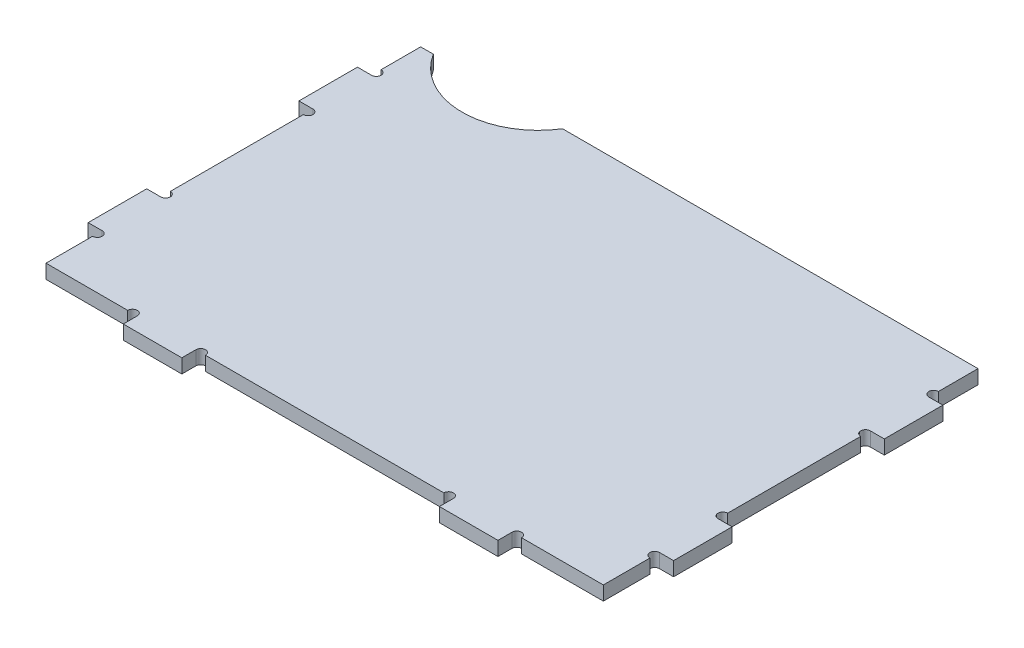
ISO-10303-21;
HEADER;
FILE_DESCRIPTION(('STEP AP214'),'2;1');
FILE_NAME('part.step','',(''),(''),'','','');
FILE_SCHEMA(('AUTOMOTIVE_DESIGN { 1 0 10303 214 1 1 1 1 }'));
ENDSEC;
DATA;
#1=APPLICATION_CONTEXT('core data for automotive mechanical design processes');
#2=APPLICATION_PROTOCOL_DEFINITION('international standard','automotive_design',2000,#1);
#3=PRODUCT_CONTEXT('',#1,'mechanical');
#4=PRODUCT('Part','Part','',(#3));
#5=PRODUCT_RELATED_PRODUCT_CATEGORY('part','',(#4));
#6=PRODUCT_DEFINITION_FORMATION('','',#4);
#7=PRODUCT_DEFINITION_CONTEXT('part definition',#1,'design');
#8=PRODUCT_DEFINITION('design','',#6,#7);
#9=PRODUCT_DEFINITION_SHAPE('','',#8);
#10=(LENGTH_UNIT() NAMED_UNIT(*) SI_UNIT(.MILLI.,.METRE.));
#11=(NAMED_UNIT(*) PLANE_ANGLE_UNIT() SI_UNIT($,.RADIAN.));
#12=(NAMED_UNIT(*) SI_UNIT($,.STERADIAN.) SOLID_ANGLE_UNIT());
#13=UNCERTAINTY_MEASURE_WITH_UNIT(LENGTH_MEASURE(1.E-05),#10,'distance_accuracy_value','');
#14=(GEOMETRIC_REPRESENTATION_CONTEXT(3) GLOBAL_UNCERTAINTY_ASSIGNED_CONTEXT((#13)) GLOBAL_UNIT_ASSIGNED_CONTEXT((#10,
#11,#12)) REPRESENTATION_CONTEXT('',''));
#15=CARTESIAN_POINT('',(0.,0.,0.));
#16=DIRECTION('',(0.,0.,1.));
#17=DIRECTION('',(1.,0.,0.));
#18=AXIS2_PLACEMENT_3D('',#15,#16,#17);
#19=CARTESIAN_POINT('',(105.9,12.,0.));
#20=DIRECTION('',(0.,-1.,0.));
#21=DIRECTION('',(0.,0.,-1.));
#22=AXIS2_PLACEMENT_3D('',#19,#20,#21);
#23=CYLINDRICAL_SURFACE('',#22,4.1);
#24=CARTESIAN_POINT('',(105.9,0.,0.));
#25=DIRECTION('',(0.,-1.,0.));
#26=DIRECTION('',(0.,0.,1.));
#27=AXIS2_PLACEMENT_3D('',#24,#25,#26);
#28=CIRCLE('',#27,4.1);
#29=CARTESIAN_POINT('',(101.8,0.,0.));
#30=VERTEX_POINT('',#29);
#31=CARTESIAN_POINT('',(110.,0.,0.));
#32=VERTEX_POINT('',#31);
#33=EDGE_CURVE('E335',#30,#32,#28,.T.);
#34=ORIENTED_EDGE('',*,*,#33,.T.);
#35=DIRECTION('',(0.,-1.,0.));
#36=VECTOR('',#35,1.);
#37=CARTESIAN_POINT('',(110.,12.,0.));
#38=LINE('',#37,#36);
#39=CARTESIAN_POINT('',(110.,12.,0.));
#40=VERTEX_POINT('',#39);
#41=EDGE_CURVE('E11',#40,#32,#38,.T.);
#42=ORIENTED_EDGE('',*,*,#41,.F.);
#43=CARTESIAN_POINT('',(105.9,12.,0.));
#44=DIRECTION('',(0.,-1.,0.));
#45=DIRECTION('',(0.,0.,1.));
#46=AXIS2_PLACEMENT_3D('',#43,#44,#45);
#47=CIRCLE('',#46,4.1);
#48=CARTESIAN_POINT('',(101.8,12.,0.));
#49=VERTEX_POINT('',#48);
#50=EDGE_CURVE('E417',#49,#40,#47,.T.);
#51=ORIENTED_EDGE('',*,*,#50,.F.);
#52=DIRECTION('',(0.,-1.,0.));
#53=VECTOR('',#52,1.);
#54=CARTESIAN_POINT('',(101.8,12.,0.));
#55=LINE('',#54,#53);
#56=EDGE_CURVE('E331',#49,#30,#55,.T.);
#57=ORIENTED_EDGE('',*,*,#56,.T.);
#58=EDGE_LOOP('',(#34,#42,#51,#57));
#59=FACE_BOUND('',#58,.T.);
#60=ADVANCED_FACE('F35',(#59),#23,.F.);
#61=CARTESIAN_POINT('',(110.,12.,0.));
#62=DIRECTION('',(1.,0.,0.));
#63=DIRECTION('',(0.,0.,-1.));
#64=AXIS2_PLACEMENT_3D('',#61,#62,#63);
#65=PLANE('',#64);
#66=DIRECTION('',(0.,0.,1.));
#67=VECTOR('',#66,1.);
#68=CARTESIAN_POINT('',(110.,0.,0.));
#69=LINE('',#68,#67);
#70=CARTESIAN_POINT('',(110.,0.,12.));
#71=VERTEX_POINT('',#70);
#72=EDGE_CURVE('E338',#32,#71,#69,.T.);
#73=ORIENTED_EDGE('',*,*,#72,.T.);
#74=DIRECTION('',(0.,-1.,0.));
#75=VECTOR('',#74,1.);
#76=CARTESIAN_POINT('',(110.,12.,12.));
#77=LINE('',#76,#75);
#78=CARTESIAN_POINT('',(110.,12.,12.));
#79=VERTEX_POINT('',#78);
#80=EDGE_CURVE('E43',#79,#71,#77,.T.);
#81=ORIENTED_EDGE('',*,*,#80,.F.);
#82=DIRECTION('',(0.,0.,1.));
#83=VECTOR('',#82,1.);
#84=CARTESIAN_POINT('',(110.,12.,0.));
#85=LINE('',#84,#83);
#86=EDGE_CURVE('E196',#40,#79,#85,.T.);
#87=ORIENTED_EDGE('',*,*,#86,.F.);
#88=ORIENTED_EDGE('',*,*,#41,.T.);
#89=EDGE_LOOP('',(#73,#81,#87,#88));
#90=FACE_BOUND('',#89,.T.);
#91=ADVANCED_FACE('F645',(#90),#65,.F.);
#92=CARTESIAN_POINT('',(110.,12.,12.));
#93=DIRECTION('',(0.,0.,-1.));
#94=DIRECTION('',(-1.,0.,0.));
#95=AXIS2_PLACEMENT_3D('',#92,#93,#94);
#96=PLANE('',#95);
#97=DIRECTION('',(1.,0.,0.));
#98=VECTOR('',#97,1.);
#99=CARTESIAN_POINT('',(110.,0.,12.));
#100=LINE('',#99,#98);
#101=CARTESIAN_POINT('',(160.,0.,12.));
#102=VERTEX_POINT('',#101);
#103=EDGE_CURVE('E340',#71,#102,#100,.T.);
#104=ORIENTED_EDGE('',*,*,#103,.T.);
#105=DIRECTION('',(0.,-1.,0.));
#106=VECTOR('',#105,1.);
#107=CARTESIAN_POINT('',(160.,12.,12.));
#108=LINE('',#107,#106);
#109=CARTESIAN_POINT('',(160.,12.,12.));
#110=VERTEX_POINT('',#109);
#111=EDGE_CURVE('E526',#110,#102,#108,.T.);
#112=ORIENTED_EDGE('',*,*,#111,.F.);
#113=DIRECTION('',(1.,0.,0.));
#114=VECTOR('',#113,1.);
#115=CARTESIAN_POINT('',(110.,12.,12.));
#116=LINE('',#115,#114);
#117=EDGE_CURVE('E534',#79,#110,#116,.T.);
#118=ORIENTED_EDGE('',*,*,#117,.F.);
#119=ORIENTED_EDGE('',*,*,#80,.T.);
#120=EDGE_LOOP('',(#104,#112,#118,#119));
#121=FACE_BOUND('',#120,.T.);
#122=ADVANCED_FACE('F532',(#121),#96,.F.);
#123=CARTESIAN_POINT('',(160.,12.,12.));
#124=DIRECTION('',(-1.,0.,0.));
#125=DIRECTION('',(0.,0.,1.));
#126=AXIS2_PLACEMENT_3D('',#123,#124,#125);
#127=PLANE('',#126);
#128=DIRECTION('',(0.,0.,-1.));
#129=VECTOR('',#128,1.);
#130=CARTESIAN_POINT('',(160.,0.,12.));
#131=LINE('',#130,#129);
#132=CARTESIAN_POINT('',(160.,0.,0.));
#133=VERTEX_POINT('',#132);
#134=EDGE_CURVE('E342',#102,#133,#131,.T.);
#135=ORIENTED_EDGE('',*,*,#134,.T.);
#136=DIRECTION('',(0.,-1.,0.));
#137=VECTOR('',#136,1.);
#138=CARTESIAN_POINT('',(160.,12.,0.));
#139=LINE('',#138,#137);
#140=CARTESIAN_POINT('',(160.,12.,0.));
#141=VERTEX_POINT('',#140);
#142=EDGE_CURVE('E523',#141,#133,#139,.T.);
#143=ORIENTED_EDGE('',*,*,#142,.F.);
#144=DIRECTION('',(0.,0.,-1.));
#145=VECTOR('',#144,1.);
#146=CARTESIAN_POINT('',(160.,12.,12.));
#147=LINE('',#146,#145);
#148=EDGE_CURVE('E552',#110,#141,#147,.T.);
#149=ORIENTED_EDGE('',*,*,#148,.F.);
#150=ORIENTED_EDGE('',*,*,#111,.T.);
#151=EDGE_LOOP('',(#135,#143,#149,#150));
#152=FACE_BOUND('',#151,.T.);
#153=ADVANCED_FACE('F543',(#152),#127,.F.);
#154=CARTESIAN_POINT('',(164.1,12.,0.));
#155=DIRECTION('',(0.,-1.,0.));
#156=DIRECTION('',(0.,0.,-1.));
#157=AXIS2_PLACEMENT_3D('',#154,#155,#156);
#158=CYLINDRICAL_SURFACE('',#157,4.09999999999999);
#159=CARTESIAN_POINT('',(164.1,0.,0.));
#160=DIRECTION('',(0.,-1.,0.));
#161=DIRECTION('',(0.,0.,-1.));
#162=AXIS2_PLACEMENT_3D('',#159,#160,#161);
#163=CIRCLE('',#162,4.09999999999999);
#164=CARTESIAN_POINT('',(168.2,0.,0.));
#165=VERTEX_POINT('',#164);
#166=EDGE_CURVE('E344',#133,#165,#163,.T.);
#167=ORIENTED_EDGE('',*,*,#166,.T.);
#168=DIRECTION('',(0.,-1.,0.));
#169=VECTOR('',#168,1.);
#170=CARTESIAN_POINT('',(168.2,12.,0.));
#171=LINE('',#170,#169);
#172=CARTESIAN_POINT('',(168.2,12.,0.));
#173=VERTEX_POINT('',#172);
#174=EDGE_CURVE('E520',#173,#165,#171,.T.);
#175=ORIENTED_EDGE('',*,*,#174,.F.);
#176=CARTESIAN_POINT('',(164.1,12.,0.));
#177=DIRECTION('',(0.,-1.,0.));
#178=DIRECTION('',(0.,0.,-1.));
#179=AXIS2_PLACEMENT_3D('',#176,#177,#178);
#180=CIRCLE('',#179,4.09999999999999);
#181=EDGE_CURVE('E549',#141,#173,#180,.T.);
#182=ORIENTED_EDGE('',*,*,#181,.F.);
#183=ORIENTED_EDGE('',*,*,#142,.T.);
#184=EDGE_LOOP('',(#167,#175,#182,#183));
#185=FACE_BOUND('',#184,.T.);
#186=ADVANCED_FACE('F547',(#185),#158,.F.);
#187=CARTESIAN_POINT('',(168.2,12.,0.));
#188=DIRECTION('',(0.,0.,-1.));
#189=DIRECTION('',(-1.,0.,0.));
#190=AXIS2_PLACEMENT_3D('',#187,#188,#189);
#191=PLANE('',#190);
#192=DIRECTION('',(1.,0.,0.));
#193=VECTOR('',#192,1.);
#194=CARTESIAN_POINT('',(168.2,0.,0.));
#195=LINE('',#194,#193);
#196=CARTESIAN_POINT('',(238.,0.,0.));
#197=VERTEX_POINT('',#196);
#198=EDGE_CURVE('E346',#165,#197,#195,.T.);
#199=ORIENTED_EDGE('',*,*,#198,.T.);
#200=DIRECTION('',(0.,-1.,0.));
#201=VECTOR('',#200,1.);
#202=CARTESIAN_POINT('',(238.,12.,0.));
#203=LINE('',#202,#201);
#204=CARTESIAN_POINT('',(238.,12.,0.));
#205=VERTEX_POINT('',#204);
#206=EDGE_CURVE('E517',#205,#197,#203,.T.);
#207=ORIENTED_EDGE('',*,*,#206,.F.);
#208=DIRECTION('',(1.,0.,0.));
#209=VECTOR('',#208,1.);
#210=CARTESIAN_POINT('',(168.2,12.,0.));
#211=LINE('',#210,#209);
#212=EDGE_CURVE('E551',#173,#205,#211,.T.);
#213=ORIENTED_EDGE('',*,*,#212,.F.);
#214=ORIENTED_EDGE('',*,*,#174,.T.);
#215=EDGE_LOOP('',(#199,#207,#213,#214));
#216=FACE_BOUND('',#215,.T.);
#217=ADVANCED_FACE('F658',(#216),#191,.F.);
#218=CARTESIAN_POINT('',(238.,12.,0.));
#219=DIRECTION('',(-1.,0.,0.));
#220=DIRECTION('',(0.,0.,1.));
#221=AXIS2_PLACEMENT_3D('',#218,#219,#220);
#222=PLANE('',#221);
#223=DIRECTION('',(0.,0.,-1.));
#224=VECTOR('',#223,1.);
#225=CARTESIAN_POINT('',(238.,0.,0.));
#226=LINE('',#225,#224);
#227=CARTESIAN_POINT('',(238.,0.,-39.8));
#228=VERTEX_POINT('',#227);
#229=EDGE_CURVE('E348',#197,#228,#226,.T.);
#230=ORIENTED_EDGE('',*,*,#229,.T.);
#231=DIRECTION('',(0.,-1.,0.));
#232=VECTOR('',#231,1.);
#233=CARTESIAN_POINT('',(238.,12.,-39.8));
#234=LINE('',#233,#232);
#235=CARTESIAN_POINT('',(238.,12.,-39.8));
#236=VERTEX_POINT('',#235);
#237=EDGE_CURVE('E514',#236,#228,#234,.T.);
#238=ORIENTED_EDGE('',*,*,#237,.F.);
#239=DIRECTION('',(0.,0.,-1.));
#240=VECTOR('',#239,1.);
#241=CARTESIAN_POINT('',(238.,12.,0.));
#242=LINE('',#241,#240);
#243=EDGE_CURVE('E554',#205,#236,#242,.T.);
#244=ORIENTED_EDGE('',*,*,#243,.F.);
#245=ORIENTED_EDGE('',*,*,#206,.T.);
#246=EDGE_LOOP('',(#230,#238,#244,#245));
#247=FACE_BOUND('',#246,.T.);
#248=ADVANCED_FACE('F661',(#247),#222,.F.);
#249=CARTESIAN_POINT('',(238.,12.,-43.9));
#250=DIRECTION('',(0.,-1.,0.));
#251=DIRECTION('',(0.,0.,-1.));
#252=AXIS2_PLACEMENT_3D('',#249,#250,#251);
#253=CYLINDRICAL_SURFACE('',#252,4.1);
#254=CARTESIAN_POINT('',(238.,0.,-43.9));
#255=DIRECTION('',(0.,-1.,0.));
#256=DIRECTION('',(0.,0.,1.));
#257=AXIS2_PLACEMENT_3D('',#254,#255,#256);
#258=CIRCLE('',#257,4.1);
#259=CARTESIAN_POINT('',(238.,0.,-48.));
#260=VERTEX_POINT('',#259);
#261=EDGE_CURVE('E350',#228,#260,#258,.T.);
#262=ORIENTED_EDGE('',*,*,#261,.T.);
#263=DIRECTION('',(0.,-1.,0.));
#264=VECTOR('',#263,1.);
#265=CARTESIAN_POINT('',(238.,12.,-48.));
#266=LINE('',#265,#264);
#267=CARTESIAN_POINT('',(238.,12.,-48.));
#268=VERTEX_POINT('',#267);
#269=EDGE_CURVE('E511',#268,#260,#266,.T.);
#270=ORIENTED_EDGE('',*,*,#269,.F.);
#271=CARTESIAN_POINT('',(238.,12.,-43.9));
#272=DIRECTION('',(0.,-1.,0.));
#273=DIRECTION('',(0.,0.,1.));
#274=AXIS2_PLACEMENT_3D('',#271,#272,#273);
#275=CIRCLE('',#274,4.1);
#276=EDGE_CURVE('E560',#236,#268,#275,.T.);
#277=ORIENTED_EDGE('',*,*,#276,.F.);
#278=ORIENTED_EDGE('',*,*,#237,.T.);
#279=EDGE_LOOP('',(#262,#270,#277,#278));
#280=FACE_BOUND('',#279,.T.);
#281=ADVANCED_FACE('F665',(#280),#253,.F.);
#282=CARTESIAN_POINT('',(238.,12.,-48.));
#283=DIRECTION('',(0.,0.,-1.));
#284=DIRECTION('',(-1.,0.,0.));
#285=AXIS2_PLACEMENT_3D('',#282,#283,#284);
#286=PLANE('',#285);
#287=DIRECTION('',(1.,0.,0.));
#288=VECTOR('',#287,1.);
#289=CARTESIAN_POINT('',(238.,0.,-48.));
#290=LINE('',#289,#288);
#291=CARTESIAN_POINT('',(250.,0.,-48.));
#292=VERTEX_POINT('',#291);
#293=EDGE_CURVE('E352',#260,#292,#290,.T.);
#294=ORIENTED_EDGE('',*,*,#293,.T.);
#295=DIRECTION('',(0.,-1.,0.));
#296=VECTOR('',#295,1.);
#297=CARTESIAN_POINT('',(250.,12.,-48.));
#298=LINE('',#297,#296);
#299=CARTESIAN_POINT('',(250.,12.,-48.));
#300=VERTEX_POINT('',#299);
#301=EDGE_CURVE('E508',#300,#292,#298,.T.);
#302=ORIENTED_EDGE('',*,*,#301,.F.);
#303=DIRECTION('',(1.,0.,0.));
#304=VECTOR('',#303,1.);
#305=CARTESIAN_POINT('',(238.,12.,-48.));
#306=LINE('',#305,#304);
#307=EDGE_CURVE('E562',#268,#300,#306,.T.);
#308=ORIENTED_EDGE('',*,*,#307,.F.);
#309=ORIENTED_EDGE('',*,*,#269,.T.);
#310=EDGE_LOOP('',(#294,#302,#308,#309));
#311=FACE_BOUND('',#310,.T.);
#312=ADVANCED_FACE('F669',(#311),#286,.F.);
#313=CARTESIAN_POINT('',(250.,12.,-48.));
#314=DIRECTION('',(-1.,0.,0.));
#315=DIRECTION('',(0.,0.,1.));
#316=AXIS2_PLACEMENT_3D('',#313,#314,#315);
#317=PLANE('',#316);
#318=DIRECTION('',(0.,0.,-1.));
#319=VECTOR('',#318,1.);
#320=CARTESIAN_POINT('',(250.,0.,-48.));
#321=LINE('',#320,#319);
#322=CARTESIAN_POINT('',(250.,0.,-98.));
#323=VERTEX_POINT('',#322);
#324=EDGE_CURVE('E354',#292,#323,#321,.T.);
#325=ORIENTED_EDGE('',*,*,#324,.T.);
#326=DIRECTION('',(0.,-1.,0.));
#327=VECTOR('',#326,1.);
#328=CARTESIAN_POINT('',(250.,12.,-98.));
#329=LINE('',#328,#327);
#330=CARTESIAN_POINT('',(250.,12.,-98.));
#331=VERTEX_POINT('',#330);
#332=EDGE_CURVE('E505',#331,#323,#329,.T.);
#333=ORIENTED_EDGE('',*,*,#332,.F.);
#334=DIRECTION('',(0.,0.,-1.));
#335=VECTOR('',#334,1.);
#336=CARTESIAN_POINT('',(250.,12.,-48.));
#337=LINE('',#336,#335);
#338=EDGE_CURVE('E564',#300,#331,#337,.T.);
#339=ORIENTED_EDGE('',*,*,#338,.F.);
#340=ORIENTED_EDGE('',*,*,#301,.T.);
#341=EDGE_LOOP('',(#325,#333,#339,#340));
#342=FACE_BOUND('',#341,.T.);
#343=ADVANCED_FACE('F673',(#342),#317,.F.);
#344=CARTESIAN_POINT('',(250.,12.,-98.));
#345=DIRECTION('',(0.,0.,1.));
#346=DIRECTION('',(1.,0.,0.));
#347=AXIS2_PLACEMENT_3D('',#344,#345,#346);
#348=PLANE('',#347);
#349=DIRECTION('',(-1.,0.,0.));
#350=VECTOR('',#349,1.);
#351=CARTESIAN_POINT('',(250.,0.,-98.));
#352=LINE('',#351,#350);
#353=CARTESIAN_POINT('',(238.,0.,-98.));
#354=VERTEX_POINT('',#353);
#355=EDGE_CURVE('E356',#323,#354,#352,.T.);
#356=ORIENTED_EDGE('',*,*,#355,.T.);
#357=DIRECTION('',(0.,-1.,0.));
#358=VECTOR('',#357,1.);
#359=CARTESIAN_POINT('',(238.,12.,-98.));
#360=LINE('',#359,#358);
#361=CARTESIAN_POINT('',(238.,12.,-98.));
#362=VERTEX_POINT('',#361);
#363=EDGE_CURVE('E502',#362,#354,#360,.T.);
#364=ORIENTED_EDGE('',*,*,#363,.F.);
#365=DIRECTION('',(-1.,0.,0.));
#366=VECTOR('',#365,1.);
#367=CARTESIAN_POINT('',(250.,12.,-98.));
#368=LINE('',#367,#366);
#369=EDGE_CURVE('E566',#331,#362,#368,.T.);
#370=ORIENTED_EDGE('',*,*,#369,.F.);
#371=ORIENTED_EDGE('',*,*,#332,.T.);
#372=EDGE_LOOP('',(#356,#364,#370,#371));
#373=FACE_BOUND('',#372,.T.);
#374=ADVANCED_FACE('F677',(#373),#348,.F.);
#375=CARTESIAN_POINT('',(238.,12.,-102.1));
#376=DIRECTION('',(0.,-1.,0.));
#377=DIRECTION('',(0.,0.,-1.));
#378=AXIS2_PLACEMENT_3D('',#375,#376,#377);
#379=CYLINDRICAL_SURFACE('',#378,4.1);
#380=CARTESIAN_POINT('',(238.,0.,-102.1));
#381=DIRECTION('',(0.,-1.,0.));
#382=DIRECTION('',(0.,0.,-1.));
#383=AXIS2_PLACEMENT_3D('',#380,#381,#382);
#384=CIRCLE('',#383,4.1);
#385=CARTESIAN_POINT('',(238.,0.,-106.2));
#386=VERTEX_POINT('',#385);
#387=EDGE_CURVE('E358',#354,#386,#384,.T.);
#388=ORIENTED_EDGE('',*,*,#387,.T.);
#389=DIRECTION('',(0.,-1.,0.));
#390=VECTOR('',#389,1.);
#391=CARTESIAN_POINT('',(238.,12.,-106.2));
#392=LINE('',#391,#390);
#393=CARTESIAN_POINT('',(238.,12.,-106.2));
#394=VERTEX_POINT('',#393);
#395=EDGE_CURVE('E499',#394,#386,#392,.T.);
#396=ORIENTED_EDGE('',*,*,#395,.F.);
#397=CARTESIAN_POINT('',(238.,12.,-102.1));
#398=DIRECTION('',(0.,-1.,0.));
#399=DIRECTION('',(0.,0.,-1.));
#400=AXIS2_PLACEMENT_3D('',#397,#398,#399);
#401=CIRCLE('',#400,4.1);
#402=EDGE_CURVE('E568',#362,#394,#401,.T.);
#403=ORIENTED_EDGE('',*,*,#402,.F.);
#404=ORIENTED_EDGE('',*,*,#363,.T.);
#405=EDGE_LOOP('',(#388,#396,#403,#404));
#406=FACE_BOUND('',#405,.T.);
#407=ADVANCED_FACE('F681',(#406),#379,.F.);
#408=CARTESIAN_POINT('',(238.,12.,-106.2));
#409=DIRECTION('',(-1.,0.,0.));
#410=DIRECTION('',(0.,0.,1.));
#411=AXIS2_PLACEMENT_3D('',#408,#409,#410);
#412=PLANE('',#411);
#413=DIRECTION('',(0.,0.,-1.));
#414=VECTOR('',#413,1.);
#415=CARTESIAN_POINT('',(238.,0.,-106.2));
#416=LINE('',#415,#414);
#417=CARTESIAN_POINT('',(238.,0.,-219.8));
#418=VERTEX_POINT('',#417);
#419=EDGE_CURVE('E360',#386,#418,#416,.T.);
#420=ORIENTED_EDGE('',*,*,#419,.T.);
#421=DIRECTION('',(0.,-1.,0.));
#422=VECTOR('',#421,1.);
#423=CARTESIAN_POINT('',(238.,12.,-219.8));
#424=LINE('',#423,#422);
#425=CARTESIAN_POINT('',(238.,12.,-219.8));
#426=VERTEX_POINT('',#425);
#427=EDGE_CURVE('E496',#426,#418,#424,.T.);
#428=ORIENTED_EDGE('',*,*,#427,.F.);
#429=DIRECTION('',(0.,0.,-1.));
#430=VECTOR('',#429,1.);
#431=CARTESIAN_POINT('',(238.,12.,-106.2));
#432=LINE('',#431,#430);
#433=EDGE_CURVE('E570',#394,#426,#432,.T.);
#434=ORIENTED_EDGE('',*,*,#433,.F.);
#435=ORIENTED_EDGE('',*,*,#395,.T.);
#436=EDGE_LOOP('',(#420,#428,#434,#435));
#437=FACE_BOUND('',#436,.T.);
#438=ADVANCED_FACE('F685',(#437),#412,.F.);
#439=CARTESIAN_POINT('',(238.,12.,-223.9));
#440=DIRECTION('',(0.,-1.,0.));
#441=DIRECTION('',(0.,0.,-1.));
#442=AXIS2_PLACEMENT_3D('',#439,#440,#441);
#443=CYLINDRICAL_SURFACE('',#442,4.09999999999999);
#444=CARTESIAN_POINT('',(238.,0.,-223.9));
#445=DIRECTION('',(0.,-1.,0.));
#446=DIRECTION('',(0.,0.,1.));
#447=AXIS2_PLACEMENT_3D('',#444,#445,#446);
#448=CIRCLE('',#447,4.09999999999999);
#449=CARTESIAN_POINT('',(238.,0.,-228.));
#450=VERTEX_POINT('',#449);
#451=EDGE_CURVE('E362',#418,#450,#448,.T.);
#452=ORIENTED_EDGE('',*,*,#451,.T.);
#453=DIRECTION('',(0.,-1.,0.));
#454=VECTOR('',#453,1.);
#455=CARTESIAN_POINT('',(238.,12.,-228.));
#456=LINE('',#455,#454);
#457=CARTESIAN_POINT('',(238.,12.,-228.));
#458=VERTEX_POINT('',#457);
#459=EDGE_CURVE('E493',#458,#450,#456,.T.);
#460=ORIENTED_EDGE('',*,*,#459,.F.);
#461=CARTESIAN_POINT('',(238.,12.,-223.9));
#462=DIRECTION('',(0.,-1.,0.));
#463=DIRECTION('',(0.,0.,1.));
#464=AXIS2_PLACEMENT_3D('',#461,#462,#463);
#465=CIRCLE('',#464,4.09999999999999);
#466=EDGE_CURVE('E572',#426,#458,#465,.T.);
#467=ORIENTED_EDGE('',*,*,#466,.F.);
#468=ORIENTED_EDGE('',*,*,#427,.T.);
#469=EDGE_LOOP('',(#452,#460,#467,#468));
#470=FACE_BOUND('',#469,.T.);
#471=ADVANCED_FACE('F689',(#470),#443,.F.);
#472=CARTESIAN_POINT('',(238.,12.,-228.));
#473=DIRECTION('',(0.,0.,-1.));
#474=DIRECTION('',(-1.,0.,0.));
#475=AXIS2_PLACEMENT_3D('',#472,#473,#474);
#476=PLANE('',#475);
#477=DIRECTION('',(1.,0.,0.));
#478=VECTOR('',#477,1.);
#479=CARTESIAN_POINT('',(238.,0.,-228.));
#480=LINE('',#479,#478);
#481=CARTESIAN_POINT('',(250.,0.,-228.));
#482=VERTEX_POINT('',#481);
#483=EDGE_CURVE('E364',#450,#482,#480,.T.);
#484=ORIENTED_EDGE('',*,*,#483,.T.);
#485=DIRECTION('',(0.,-1.,0.));
#486=VECTOR('',#485,1.);
#487=CARTESIAN_POINT('',(250.,12.,-228.));
#488=LINE('',#487,#486);
#489=CARTESIAN_POINT('',(250.,12.,-228.));
#490=VERTEX_POINT('',#489);
#491=EDGE_CURVE('E490',#490,#482,#488,.T.);
#492=ORIENTED_EDGE('',*,*,#491,.F.);
#493=DIRECTION('',(1.,0.,0.));
#494=VECTOR('',#493,1.);
#495=CARTESIAN_POINT('',(238.,12.,-228.));
#496=LINE('',#495,#494);
#497=EDGE_CURVE('E574',#458,#490,#496,.T.);
#498=ORIENTED_EDGE('',*,*,#497,.F.);
#499=ORIENTED_EDGE('',*,*,#459,.T.);
#500=EDGE_LOOP('',(#484,#492,#498,#499));
#501=FACE_BOUND('',#500,.T.);
#502=ADVANCED_FACE('F693',(#501),#476,.F.);
#503=CARTESIAN_POINT('',(250.,12.,-228.));
#504=DIRECTION('',(-1.,0.,0.));
#505=DIRECTION('',(0.,0.,1.));
#506=AXIS2_PLACEMENT_3D('',#503,#504,#505);
#507=PLANE('',#506);
#508=DIRECTION('',(0.,0.,-1.));
#509=VECTOR('',#508,1.);
#510=CARTESIAN_POINT('',(250.,0.,-228.));
#511=LINE('',#510,#509);
#512=CARTESIAN_POINT('',(250.,0.,-278.));
#513=VERTEX_POINT('',#512);
#514=EDGE_CURVE('E366',#482,#513,#511,.T.);
#515=ORIENTED_EDGE('',*,*,#514,.T.);
#516=DIRECTION('',(0.,-1.,0.));
#517=VECTOR('',#516,1.);
#518=CARTESIAN_POINT('',(250.,12.,-278.));
#519=LINE('',#518,#517);
#520=CARTESIAN_POINT('',(250.,12.,-278.));
#521=VERTEX_POINT('',#520);
#522=EDGE_CURVE('E487',#521,#513,#519,.T.);
#523=ORIENTED_EDGE('',*,*,#522,.F.);
#524=DIRECTION('',(0.,0.,-1.));
#525=VECTOR('',#524,1.);
#526=CARTESIAN_POINT('',(250.,12.,-228.));
#527=LINE('',#526,#525);
#528=EDGE_CURVE('E576',#490,#521,#527,.T.);
#529=ORIENTED_EDGE('',*,*,#528,.F.);
#530=ORIENTED_EDGE('',*,*,#491,.T.);
#531=EDGE_LOOP('',(#515,#523,#529,#530));
#532=FACE_BOUND('',#531,.T.);
#533=ADVANCED_FACE('F697',(#532),#507,.F.);
#534=CARTESIAN_POINT('',(250.,12.,-278.));
#535=DIRECTION('',(0.,0.,1.));
#536=DIRECTION('',(1.,0.,0.));
#537=AXIS2_PLACEMENT_3D('',#534,#535,#536);
#538=PLANE('',#537);
#539=DIRECTION('',(-1.,0.,0.));
#540=VECTOR('',#539,1.);
#541=CARTESIAN_POINT('',(250.,0.,-278.));
#542=LINE('',#541,#540);
#543=CARTESIAN_POINT('',(238.,0.,-278.));
#544=VERTEX_POINT('',#543);
#545=EDGE_CURVE('E368',#513,#544,#542,.T.);
#546=ORIENTED_EDGE('',*,*,#545,.T.);
#547=DIRECTION('',(0.,-1.,0.));
#548=VECTOR('',#547,1.);
#549=CARTESIAN_POINT('',(238.,12.,-278.));
#550=LINE('',#549,#548);
#551=CARTESIAN_POINT('',(238.,12.,-278.));
#552=VERTEX_POINT('',#551);
#553=EDGE_CURVE('E484',#552,#544,#550,.T.);
#554=ORIENTED_EDGE('',*,*,#553,.F.);
#555=DIRECTION('',(-1.,0.,0.));
#556=VECTOR('',#555,1.);
#557=CARTESIAN_POINT('',(250.,12.,-278.));
#558=LINE('',#557,#556);
#559=EDGE_CURVE('E578',#521,#552,#558,.T.);
#560=ORIENTED_EDGE('',*,*,#559,.F.);
#561=ORIENTED_EDGE('',*,*,#522,.T.);
#562=EDGE_LOOP('',(#546,#554,#560,#561));
#563=FACE_BOUND('',#562,.T.);
#564=ADVANCED_FACE('F701',(#563),#538,.F.);
#565=CARTESIAN_POINT('',(238.,12.,-282.1));
#566=DIRECTION('',(0.,-1.,0.));
#567=DIRECTION('',(0.,0.,-1.));
#568=AXIS2_PLACEMENT_3D('',#565,#566,#567);
#569=CYLINDRICAL_SURFACE('',#568,4.09999999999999);
#570=CARTESIAN_POINT('',(238.,0.,-282.1));
#571=DIRECTION('',(0.,-1.,0.));
#572=DIRECTION('',(0.,0.,-1.));
#573=AXIS2_PLACEMENT_3D('',#570,#571,#572);
#574=CIRCLE('',#573,4.09999999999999);
#575=CARTESIAN_POINT('',(238.,0.,-286.2));
#576=VERTEX_POINT('',#575);
#577=EDGE_CURVE('E370',#544,#576,#574,.T.);
#578=ORIENTED_EDGE('',*,*,#577,.T.);
#579=DIRECTION('',(0.,-1.,0.));
#580=VECTOR('',#579,1.);
#581=CARTESIAN_POINT('',(238.,12.,-286.2));
#582=LINE('',#581,#580);
#583=CARTESIAN_POINT('',(238.,12.,-286.2));
#584=VERTEX_POINT('',#583);
#585=EDGE_CURVE('E481',#584,#576,#582,.T.);
#586=ORIENTED_EDGE('',*,*,#585,.F.);
#587=CARTESIAN_POINT('',(238.,12.,-282.1));
#588=DIRECTION('',(0.,-1.,0.));
#589=DIRECTION('',(0.,0.,-1.));
#590=AXIS2_PLACEMENT_3D('',#587,#588,#589);
#591=CIRCLE('',#590,4.09999999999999);
#592=EDGE_CURVE('E580',#552,#584,#591,.T.);
#593=ORIENTED_EDGE('',*,*,#592,.F.);
#594=ORIENTED_EDGE('',*,*,#553,.T.);
#595=EDGE_LOOP('',(#578,#586,#593,#594));
#596=FACE_BOUND('',#595,.T.);
#597=ADVANCED_FACE('F705',(#596),#569,.F.);
#598=CARTESIAN_POINT('',(238.,12.,-286.2));
#599=DIRECTION('',(-1.,0.,0.));
#600=DIRECTION('',(0.,0.,1.));
#601=AXIS2_PLACEMENT_3D('',#598,#599,#600);
#602=PLANE('',#601);
#603=DIRECTION('',(0.,0.,-1.));
#604=VECTOR('',#603,1.);
#605=CARTESIAN_POINT('',(238.,0.,-286.2));
#606=LINE('',#605,#604);
#607=CARTESIAN_POINT('',(238.,0.,-320.));
#608=VERTEX_POINT('',#607);
#609=EDGE_CURVE('E372',#576,#608,#606,.T.);
#610=ORIENTED_EDGE('',*,*,#609,.T.);
#611=DIRECTION('',(0.,-1.,0.));
#612=VECTOR('',#611,1.);
#613=CARTESIAN_POINT('',(238.,12.,-320.));
#614=LINE('',#613,#612);
#615=CARTESIAN_POINT('',(238.,12.,-320.));
#616=VERTEX_POINT('',#615);
#617=EDGE_CURVE('E478',#616,#608,#614,.T.);
#618=ORIENTED_EDGE('',*,*,#617,.F.);
#619=DIRECTION('',(0.,0.,-1.));
#620=VECTOR('',#619,1.);
#621=CARTESIAN_POINT('',(238.,12.,-286.2));
#622=LINE('',#621,#620);
#623=EDGE_CURVE('E582',#584,#616,#622,.T.);
#624=ORIENTED_EDGE('',*,*,#623,.F.);
#625=ORIENTED_EDGE('',*,*,#585,.T.);
#626=EDGE_LOOP('',(#610,#618,#624,#625));
#627=FACE_BOUND('',#626,.T.);
#628=ADVANCED_FACE('F709',(#627),#602,.F.);
#629=CARTESIAN_POINT('',(238.,12.,-320.));
#630=DIRECTION('',(0.,0.,1.));
#631=DIRECTION('',(1.,0.,0.));
#632=AXIS2_PLACEMENT_3D('',#629,#630,#631);
#633=PLANE('',#632);
#634=DIRECTION('',(-1.,0.,0.));
#635=VECTOR('',#634,1.);
#636=CARTESIAN_POINT('',(238.,0.,-320.));
#637=LINE('',#636,#635);
#638=CARTESIAN_POINT('',(-116.824005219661,0.,-320.));
#639=VERTEX_POINT('',#638);
#640=EDGE_CURVE('E374',#608,#639,#637,.T.);
#641=ORIENTED_EDGE('',*,*,#640,.T.);
#642=DIRECTION('',(0.,-1.,0.));
#643=VECTOR('',#642,1.);
#644=CARTESIAN_POINT('',(-116.824005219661,12.,-320.));
#645=LINE('',#644,#643);
#646=CARTESIAN_POINT('',(-116.824005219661,12.,-320.));
#647=VERTEX_POINT('',#646);
#648=EDGE_CURVE('E475',#647,#639,#645,.T.);
#649=ORIENTED_EDGE('',*,*,#648,.F.);
#650=DIRECTION('',(-1.,0.,0.));
#651=VECTOR('',#650,1.);
#652=CARTESIAN_POINT('',(238.,12.,-320.));
#653=LINE('',#652,#651);
#654=EDGE_CURVE('E584',#616,#647,#653,.T.);
#655=ORIENTED_EDGE('',*,*,#654,.F.);
#656=ORIENTED_EDGE('',*,*,#617,.T.);
#657=EDGE_LOOP('',(#641,#649,#655,#656));
#658=FACE_BOUND('',#657,.T.);
#659=ADVANCED_FACE('F713',(#658),#633,.F.);
#660=CARTESIAN_POINT('',(-172.,12.,-354.36));
#661=DIRECTION('',(0.,-1.,0.));
#662=DIRECTION('',(0.,0.,-1.));
#663=AXIS2_PLACEMENT_3D('',#660,#661,#662);
#664=CYLINDRICAL_SURFACE('',#663,65.);
#665=CARTESIAN_POINT('',(-172.,0.,-354.36));
#666=DIRECTION('',(0.,-1.,0.));
#667=DIRECTION('',(0.,0.,1.));
#668=AXIS2_PLACEMENT_3D('',#665,#666,#667);
#669=CIRCLE('',#668,65.);
#670=CARTESIAN_POINT('',(-227.175994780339,0.,-320.));
#671=VERTEX_POINT('',#670);
#672=EDGE_CURVE('E376',#639,#671,#669,.T.);
#673=ORIENTED_EDGE('',*,*,#672,.T.);
#674=DIRECTION('',(0.,-1.,0.));
#675=VECTOR('',#674,1.);
#676=CARTESIAN_POINT('',(-227.175994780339,12.,-320.));
#677=LINE('',#676,#675);
#678=CARTESIAN_POINT('',(-227.175994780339,12.,-320.));
#679=VERTEX_POINT('',#678);
#680=EDGE_CURVE('E472',#679,#671,#677,.T.);
#681=ORIENTED_EDGE('',*,*,#680,.F.);
#682=CARTESIAN_POINT('',(-172.,12.,-354.36));
#683=DIRECTION('',(0.,-1.,0.));
#684=DIRECTION('',(0.,0.,1.));
#685=AXIS2_PLACEMENT_3D('',#682,#683,#684);
#686=CIRCLE('',#685,65.);
#687=EDGE_CURVE('E586',#647,#679,#686,.T.);
#688=ORIENTED_EDGE('',*,*,#687,.F.);
#689=ORIENTED_EDGE('',*,*,#648,.T.);
#690=EDGE_LOOP('',(#673,#681,#688,#689));
#691=FACE_BOUND('',#690,.T.);
#692=ADVANCED_FACE('F717',(#691),#664,.F.);
#693=CARTESIAN_POINT('',(-238.,12.,-320.));
#694=DIRECTION('',(0.,0.,1.));
#695=DIRECTION('',(1.,0.,0.));
#696=AXIS2_PLACEMENT_3D('',#693,#694,#695);
#697=PLANE('',#696);
#698=DIRECTION('',(-1.,0.,0.));
#699=VECTOR('',#698,1.);
#700=CARTESIAN_POINT('',(-238.,0.,-320.));
#701=LINE('',#700,#699);
#702=CARTESIAN_POINT('',(-238.,0.,-320.));
#703=VERTEX_POINT('',#702);
#704=EDGE_CURVE('E378',#671,#703,#701,.T.);
#705=ORIENTED_EDGE('',*,*,#704,.T.);
#706=DIRECTION('',(0.,-1.,0.));
#707=VECTOR('',#706,1.);
#708=CARTESIAN_POINT('',(-238.,12.,-320.));
#709=LINE('',#708,#707);
#710=CARTESIAN_POINT('',(-238.,12.,-320.));
#711=VERTEX_POINT('',#710);
#712=EDGE_CURVE('E469',#711,#703,#709,.T.);
#713=ORIENTED_EDGE('',*,*,#712,.F.);
#714=DIRECTION('',(-1.,0.,0.));
#715=VECTOR('',#714,1.);
#716=CARTESIAN_POINT('',(-238.,12.,-320.));
#717=LINE('',#716,#715);
#718=EDGE_CURVE('E588',#679,#711,#717,.T.);
#719=ORIENTED_EDGE('',*,*,#718,.F.);
#720=ORIENTED_EDGE('',*,*,#680,.T.);
#721=EDGE_LOOP('',(#705,#713,#719,#720));
#722=FACE_BOUND('',#721,.T.);
#723=ADVANCED_FACE('F721',(#722),#697,.F.);
#724=CARTESIAN_POINT('',(-238.,12.,-286.2));
#725=DIRECTION('',(1.,0.,0.));
#726=DIRECTION('',(0.,0.,-1.));
#727=AXIS2_PLACEMENT_3D('',#724,#725,#726);
#728=PLANE('',#727);
#729=DIRECTION('',(0.,0.,1.));
#730=VECTOR('',#729,1.);
#731=CARTESIAN_POINT('',(-238.,0.,-286.2));
#732=LINE('',#731,#730);
#733=CARTESIAN_POINT('',(-238.,0.,-286.2));
#734=VERTEX_POINT('',#733);
#735=EDGE_CURVE('E380',#703,#734,#732,.T.);
#736=ORIENTED_EDGE('',*,*,#735,.T.);
#737=DIRECTION('',(0.,-1.,0.));
#738=VECTOR('',#737,1.);
#739=CARTESIAN_POINT('',(-238.,12.,-286.2));
#740=LINE('',#739,#738);
#741=CARTESIAN_POINT('',(-238.,12.,-286.2));
#742=VERTEX_POINT('',#741);
#743=EDGE_CURVE('E466',#742,#734,#740,.T.);
#744=ORIENTED_EDGE('',*,*,#743,.F.);
#745=DIRECTION('',(0.,0.,1.));
#746=VECTOR('',#745,1.);
#747=CARTESIAN_POINT('',(-238.,12.,-286.2));
#748=LINE('',#747,#746);
#749=EDGE_CURVE('E590',#711,#742,#748,.T.);
#750=ORIENTED_EDGE('',*,*,#749,.F.);
#751=ORIENTED_EDGE('',*,*,#712,.T.);
#752=EDGE_LOOP('',(#736,#744,#750,#751));
#753=FACE_BOUND('',#752,.T.);
#754=ADVANCED_FACE('F725',(#753),#728,.F.);
#755=CARTESIAN_POINT('',(-238.,12.,-282.1));
#756=DIRECTION('',(0.,-1.,0.));
#757=DIRECTION('',(0.,0.,-1.));
#758=AXIS2_PLACEMENT_3D('',#755,#756,#757);
#759=CYLINDRICAL_SURFACE('',#758,4.09999999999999);
#760=CARTESIAN_POINT('',(-238.,0.,-282.1));
#761=DIRECTION('',(0.,-1.,0.));
#762=DIRECTION('',(0.,0.,1.));
#763=AXIS2_PLACEMENT_3D('',#760,#761,#762);
#764=CIRCLE('',#763,4.09999999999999);
#765=CARTESIAN_POINT('',(-238.,0.,-278.));
#766=VERTEX_POINT('',#765);
#767=EDGE_CURVE('E382',#734,#766,#764,.T.);
#768=ORIENTED_EDGE('',*,*,#767,.T.);
#769=DIRECTION('',(0.,-1.,0.));
#770=VECTOR('',#769,1.);
#771=CARTESIAN_POINT('',(-238.,12.,-278.));
#772=LINE('',#771,#770);
#773=CARTESIAN_POINT('',(-238.,12.,-278.));
#774=VERTEX_POINT('',#773);
#775=EDGE_CURVE('E463',#774,#766,#772,.T.);
#776=ORIENTED_EDGE('',*,*,#775,.F.);
#777=CARTESIAN_POINT('',(-238.,12.,-282.1));
#778=DIRECTION('',(0.,-1.,0.));
#779=DIRECTION('',(0.,0.,1.));
#780=AXIS2_PLACEMENT_3D('',#777,#778,#779);
#781=CIRCLE('',#780,4.09999999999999);
#782=EDGE_CURVE('E592',#742,#774,#781,.T.);
#783=ORIENTED_EDGE('',*,*,#782,.F.);
#784=ORIENTED_EDGE('',*,*,#743,.T.);
#785=EDGE_LOOP('',(#768,#776,#783,#784));
#786=FACE_BOUND('',#785,.T.);
#787=ADVANCED_FACE('F729',(#786),#759,.F.);
#788=CARTESIAN_POINT('',(-250.,12.,-278.));
#789=DIRECTION('',(0.,0.,1.));
#790=DIRECTION('',(1.,0.,0.));
#791=AXIS2_PLACEMENT_3D('',#788,#789,#790);
#792=PLANE('',#791);
#793=DIRECTION('',(-1.,0.,0.));
#794=VECTOR('',#793,1.);
#795=CARTESIAN_POINT('',(-250.,0.,-278.));
#796=LINE('',#795,#794);
#797=CARTESIAN_POINT('',(-250.,0.,-278.));
#798=VERTEX_POINT('',#797);
#799=EDGE_CURVE('E384',#766,#798,#796,.T.);
#800=ORIENTED_EDGE('',*,*,#799,.T.);
#801=DIRECTION('',(0.,-1.,0.));
#802=VECTOR('',#801,1.);
#803=CARTESIAN_POINT('',(-250.,12.,-278.));
#804=LINE('',#803,#802);
#805=CARTESIAN_POINT('',(-250.,12.,-278.));
#806=VERTEX_POINT('',#805);
#807=EDGE_CURVE('E460',#806,#798,#804,.T.);
#808=ORIENTED_EDGE('',*,*,#807,.F.);
#809=DIRECTION('',(-1.,0.,0.));
#810=VECTOR('',#809,1.);
#811=CARTESIAN_POINT('',(-250.,12.,-278.));
#812=LINE('',#811,#810);
#813=EDGE_CURVE('E594',#774,#806,#812,.T.);
#814=ORIENTED_EDGE('',*,*,#813,.F.);
#815=ORIENTED_EDGE('',*,*,#775,.T.);
#816=EDGE_LOOP('',(#800,#808,#814,#815));
#817=FACE_BOUND('',#816,.T.);
#818=ADVANCED_FACE('F733',(#817),#792,.F.);
#819=CARTESIAN_POINT('',(-250.,12.,-228.));
#820=DIRECTION('',(1.,0.,0.));
#821=DIRECTION('',(0.,0.,-1.));
#822=AXIS2_PLACEMENT_3D('',#819,#820,#821);
#823=PLANE('',#822);
#824=DIRECTION('',(0.,0.,1.));
#825=VECTOR('',#824,1.);
#826=CARTESIAN_POINT('',(-250.,0.,-228.));
#827=LINE('',#826,#825);
#828=CARTESIAN_POINT('',(-250.,0.,-228.));
#829=VERTEX_POINT('',#828);
#830=EDGE_CURVE('E386',#798,#829,#827,.T.);
#831=ORIENTED_EDGE('',*,*,#830,.T.);
#832=DIRECTION('',(0.,-1.,0.));
#833=VECTOR('',#832,1.);
#834=CARTESIAN_POINT('',(-250.,12.,-228.));
#835=LINE('',#834,#833);
#836=CARTESIAN_POINT('',(-250.,12.,-228.));
#837=VERTEX_POINT('',#836);
#838=EDGE_CURVE('E457',#837,#829,#835,.T.);
#839=ORIENTED_EDGE('',*,*,#838,.F.);
#840=DIRECTION('',(0.,0.,1.));
#841=VECTOR('',#840,1.);
#842=CARTESIAN_POINT('',(-250.,12.,-228.));
#843=LINE('',#842,#841);
#844=EDGE_CURVE('E596',#806,#837,#843,.T.);
#845=ORIENTED_EDGE('',*,*,#844,.F.);
#846=ORIENTED_EDGE('',*,*,#807,.T.);
#847=EDGE_LOOP('',(#831,#839,#845,#846));
#848=FACE_BOUND('',#847,.T.);
#849=ADVANCED_FACE('F737',(#848),#823,.F.);
#850=CARTESIAN_POINT('',(-238.,12.,-228.));
#851=DIRECTION('',(0.,0.,-1.));
#852=DIRECTION('',(-1.,0.,0.));
#853=AXIS2_PLACEMENT_3D('',#850,#851,#852);
#854=PLANE('',#853);
#855=DIRECTION('',(1.,0.,0.));
#856=VECTOR('',#855,1.);
#857=CARTESIAN_POINT('',(-238.,0.,-228.));
#858=LINE('',#857,#856);
#859=CARTESIAN_POINT('',(-238.,0.,-228.));
#860=VERTEX_POINT('',#859);
#861=EDGE_CURVE('E388',#829,#860,#858,.T.);
#862=ORIENTED_EDGE('',*,*,#861,.T.);
#863=DIRECTION('',(0.,-1.,0.));
#864=VECTOR('',#863,1.);
#865=CARTESIAN_POINT('',(-238.,12.,-228.));
#866=LINE('',#865,#864);
#867=CARTESIAN_POINT('',(-238.,12.,-228.));
#868=VERTEX_POINT('',#867);
#869=EDGE_CURVE('E454',#868,#860,#866,.T.);
#870=ORIENTED_EDGE('',*,*,#869,.F.);
#871=DIRECTION('',(1.,0.,0.));
#872=VECTOR('',#871,1.);
#873=CARTESIAN_POINT('',(-238.,12.,-228.));
#874=LINE('',#873,#872);
#875=EDGE_CURVE('E598',#837,#868,#874,.T.);
#876=ORIENTED_EDGE('',*,*,#875,.F.);
#877=ORIENTED_EDGE('',*,*,#838,.T.);
#878=EDGE_LOOP('',(#862,#870,#876,#877));
#879=FACE_BOUND('',#878,.T.);
#880=ADVANCED_FACE('F741',(#879),#854,.F.);
#881=CARTESIAN_POINT('',(-238.,12.,-223.9));
#882=DIRECTION('',(0.,-1.,0.));
#883=DIRECTION('',(0.,0.,-1.));
#884=AXIS2_PLACEMENT_3D('',#881,#882,#883);
#885=CYLINDRICAL_SURFACE('',#884,4.09999999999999);
#886=CARTESIAN_POINT('',(-238.,0.,-223.9));
#887=DIRECTION('',(0.,-1.,0.));
#888=DIRECTION('',(0.,0.,-1.));
#889=AXIS2_PLACEMENT_3D('',#886,#887,#888);
#890=CIRCLE('',#889,4.09999999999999);
#891=CARTESIAN_POINT('',(-238.,0.,-219.8));
#892=VERTEX_POINT('',#891);
#893=EDGE_CURVE('E390',#860,#892,#890,.T.);
#894=ORIENTED_EDGE('',*,*,#893,.T.);
#895=DIRECTION('',(0.,-1.,0.));
#896=VECTOR('',#895,1.);
#897=CARTESIAN_POINT('',(-238.,12.,-219.8));
#898=LINE('',#897,#896);
#899=CARTESIAN_POINT('',(-238.,12.,-219.8));
#900=VERTEX_POINT('',#899);
#901=EDGE_CURVE('E451',#900,#892,#898,.T.);
#902=ORIENTED_EDGE('',*,*,#901,.F.);
#903=CARTESIAN_POINT('',(-238.,12.,-223.9));
#904=DIRECTION('',(0.,-1.,0.));
#905=DIRECTION('',(0.,0.,-1.));
#906=AXIS2_PLACEMENT_3D('',#903,#904,#905);
#907=CIRCLE('',#906,4.09999999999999);
#908=EDGE_CURVE('E600',#868,#900,#907,.T.);
#909=ORIENTED_EDGE('',*,*,#908,.F.);
#910=ORIENTED_EDGE('',*,*,#869,.T.);
#911=EDGE_LOOP('',(#894,#902,#909,#910));
#912=FACE_BOUND('',#911,.T.);
#913=ADVANCED_FACE('F745',(#912),#885,.F.);
#914=CARTESIAN_POINT('',(-238.,12.,-106.2));
#915=DIRECTION('',(1.,0.,0.));
#916=DIRECTION('',(0.,0.,-1.));
#917=AXIS2_PLACEMENT_3D('',#914,#915,#916);
#918=PLANE('',#917);
#919=DIRECTION('',(0.,0.,1.));
#920=VECTOR('',#919,1.);
#921=CARTESIAN_POINT('',(-238.,0.,-106.2));
#922=LINE('',#921,#920);
#923=CARTESIAN_POINT('',(-238.,0.,-106.2));
#924=VERTEX_POINT('',#923);
#925=EDGE_CURVE('E392',#892,#924,#922,.T.);
#926=ORIENTED_EDGE('',*,*,#925,.T.);
#927=DIRECTION('',(0.,-1.,0.));
#928=VECTOR('',#927,1.);
#929=CARTESIAN_POINT('',(-238.,12.,-106.2));
#930=LINE('',#929,#928);
#931=CARTESIAN_POINT('',(-238.,12.,-106.2));
#932=VERTEX_POINT('',#931);
#933=EDGE_CURVE('E448',#932,#924,#930,.T.);
#934=ORIENTED_EDGE('',*,*,#933,.F.);
#935=DIRECTION('',(0.,0.,1.));
#936=VECTOR('',#935,1.);
#937=CARTESIAN_POINT('',(-238.,12.,-106.2));
#938=LINE('',#937,#936);
#939=EDGE_CURVE('E602',#900,#932,#938,.T.);
#940=ORIENTED_EDGE('',*,*,#939,.F.);
#941=ORIENTED_EDGE('',*,*,#901,.T.);
#942=EDGE_LOOP('',(#926,#934,#940,#941));
#943=FACE_BOUND('',#942,.T.);
#944=ADVANCED_FACE('F749',(#943),#918,.F.);
#945=CARTESIAN_POINT('',(-238.,12.,-102.1));
#946=DIRECTION('',(0.,-1.,0.));
#947=DIRECTION('',(0.,0.,-1.));
#948=AXIS2_PLACEMENT_3D('',#945,#946,#947);
#949=CYLINDRICAL_SURFACE('',#948,4.1);
#950=CARTESIAN_POINT('',(-238.,0.,-102.1));
#951=DIRECTION('',(0.,-1.,0.));
#952=DIRECTION('',(0.,0.,1.));
#953=AXIS2_PLACEMENT_3D('',#950,#951,#952);
#954=CIRCLE('',#953,4.1);
#955=CARTESIAN_POINT('',(-238.,0.,-98.));
#956=VERTEX_POINT('',#955);
#957=EDGE_CURVE('E394',#924,#956,#954,.T.);
#958=ORIENTED_EDGE('',*,*,#957,.T.);
#959=DIRECTION('',(0.,-1.,0.));
#960=VECTOR('',#959,1.);
#961=CARTESIAN_POINT('',(-238.,12.,-98.));
#962=LINE('',#961,#960);
#963=CARTESIAN_POINT('',(-238.,12.,-98.));
#964=VERTEX_POINT('',#963);
#965=EDGE_CURVE('E445',#964,#956,#962,.T.);
#966=ORIENTED_EDGE('',*,*,#965,.F.);
#967=CARTESIAN_POINT('',(-238.,12.,-102.1));
#968=DIRECTION('',(0.,-1.,0.));
#969=DIRECTION('',(0.,0.,1.));
#970=AXIS2_PLACEMENT_3D('',#967,#968,#969);
#971=CIRCLE('',#970,4.1);
#972=EDGE_CURVE('E604',#932,#964,#971,.T.);
#973=ORIENTED_EDGE('',*,*,#972,.F.);
#974=ORIENTED_EDGE('',*,*,#933,.T.);
#975=EDGE_LOOP('',(#958,#966,#973,#974));
#976=FACE_BOUND('',#975,.T.);
#977=ADVANCED_FACE('F753',(#976),#949,.F.);
#978=CARTESIAN_POINT('',(-250.,12.,-98.));
#979=DIRECTION('',(0.,0.,1.));
#980=DIRECTION('',(1.,0.,0.));
#981=AXIS2_PLACEMENT_3D('',#978,#979,#980);
#982=PLANE('',#981);
#983=DIRECTION('',(-1.,0.,0.));
#984=VECTOR('',#983,1.);
#985=CARTESIAN_POINT('',(-250.,0.,-98.));
#986=LINE('',#985,#984);
#987=CARTESIAN_POINT('',(-250.,0.,-98.));
#988=VERTEX_POINT('',#987);
#989=EDGE_CURVE('E396',#956,#988,#986,.T.);
#990=ORIENTED_EDGE('',*,*,#989,.T.);
#991=DIRECTION('',(0.,-1.,0.));
#992=VECTOR('',#991,1.);
#993=CARTESIAN_POINT('',(-250.,12.,-98.));
#994=LINE('',#993,#992);
#995=CARTESIAN_POINT('',(-250.,12.,-98.));
#996=VERTEX_POINT('',#995);
#997=EDGE_CURVE('E442',#996,#988,#994,.T.);
#998=ORIENTED_EDGE('',*,*,#997,.F.);
#999=DIRECTION('',(-1.,0.,0.));
#1000=VECTOR('',#999,1.);
#1001=CARTESIAN_POINT('',(-250.,12.,-98.));
#1002=LINE('',#1001,#1000);
#1003=EDGE_CURVE('E606',#964,#996,#1002,.T.);
#1004=ORIENTED_EDGE('',*,*,#1003,.F.);
#1005=ORIENTED_EDGE('',*,*,#965,.T.);
#1006=EDGE_LOOP('',(#990,#998,#1004,#1005));
#1007=FACE_BOUND('',#1006,.T.);
#1008=ADVANCED_FACE('F757',(#1007),#982,.F.);
#1009=CARTESIAN_POINT('',(-250.,12.,-48.));
#1010=DIRECTION('',(1.,0.,0.));
#1011=DIRECTION('',(0.,0.,-1.));
#1012=AXIS2_PLACEMENT_3D('',#1009,#1010,#1011);
#1013=PLANE('',#1012);
#1014=DIRECTION('',(0.,0.,1.));
#1015=VECTOR('',#1014,1.);
#1016=CARTESIAN_POINT('',(-250.,0.,-48.));
#1017=LINE('',#1016,#1015);
#1018=CARTESIAN_POINT('',(-250.,0.,-48.));
#1019=VERTEX_POINT('',#1018);
#1020=EDGE_CURVE('E398',#988,#1019,#1017,.T.);
#1021=ORIENTED_EDGE('',*,*,#1020,.T.);
#1022=DIRECTION('',(0.,-1.,0.));
#1023=VECTOR('',#1022,1.);
#1024=CARTESIAN_POINT('',(-250.,12.,-48.));
#1025=LINE('',#1024,#1023);
#1026=CARTESIAN_POINT('',(-250.,12.,-48.));
#1027=VERTEX_POINT('',#1026);
#1028=EDGE_CURVE('E439',#1027,#1019,#1025,.T.);
#1029=ORIENTED_EDGE('',*,*,#1028,.F.);
#1030=DIRECTION('',(0.,0.,1.));
#1031=VECTOR('',#1030,1.);
#1032=CARTESIAN_POINT('',(-250.,12.,-48.));
#1033=LINE('',#1032,#1031);
#1034=EDGE_CURVE('E608',#996,#1027,#1033,.T.);
#1035=ORIENTED_EDGE('',*,*,#1034,.F.);
#1036=ORIENTED_EDGE('',*,*,#997,.T.);
#1037=EDGE_LOOP('',(#1021,#1029,#1035,#1036));
#1038=FACE_BOUND('',#1037,.T.);
#1039=ADVANCED_FACE('F761',(#1038),#1013,.F.);
#1040=CARTESIAN_POINT('',(-238.,12.,-48.));
#1041=DIRECTION('',(0.,0.,-1.));
#1042=DIRECTION('',(-1.,0.,0.));
#1043=AXIS2_PLACEMENT_3D('',#1040,#1041,#1042);
#1044=PLANE('',#1043);
#1045=DIRECTION('',(1.,0.,0.));
#1046=VECTOR('',#1045,1.);
#1047=CARTESIAN_POINT('',(-238.,0.,-48.));
#1048=LINE('',#1047,#1046);
#1049=CARTESIAN_POINT('',(-238.,0.,-48.));
#1050=VERTEX_POINT('',#1049);
#1051=EDGE_CURVE('E400',#1019,#1050,#1048,.T.);
#1052=ORIENTED_EDGE('',*,*,#1051,.T.);
#1053=DIRECTION('',(0.,-1.,0.));
#1054=VECTOR('',#1053,1.);
#1055=CARTESIAN_POINT('',(-238.,12.,-48.));
#1056=LINE('',#1055,#1054);
#1057=CARTESIAN_POINT('',(-238.,12.,-48.));
#1058=VERTEX_POINT('',#1057);
#1059=EDGE_CURVE('E436',#1058,#1050,#1056,.T.);
#1060=ORIENTED_EDGE('',*,*,#1059,.F.);
#1061=DIRECTION('',(1.,0.,0.));
#1062=VECTOR('',#1061,1.);
#1063=CARTESIAN_POINT('',(-238.,12.,-48.));
#1064=LINE('',#1063,#1062);
#1065=EDGE_CURVE('E610',#1027,#1058,#1064,.T.);
#1066=ORIENTED_EDGE('',*,*,#1065,.F.);
#1067=ORIENTED_EDGE('',*,*,#1028,.T.);
#1068=EDGE_LOOP('',(#1052,#1060,#1066,#1067));
#1069=FACE_BOUND('',#1068,.T.);
#1070=ADVANCED_FACE('F765',(#1069),#1044,.F.);
#1071=CARTESIAN_POINT('',(-238.,12.,-43.9));
#1072=DIRECTION('',(0.,-1.,0.));
#1073=DIRECTION('',(0.,0.,-1.));
#1074=AXIS2_PLACEMENT_3D('',#1071,#1072,#1073);
#1075=CYLINDRICAL_SURFACE('',#1074,4.1);
#1076=CARTESIAN_POINT('',(-238.,0.,-43.9));
#1077=DIRECTION('',(0.,-1.,0.));
#1078=DIRECTION('',(0.,0.,-1.));
#1079=AXIS2_PLACEMENT_3D('',#1076,#1077,#1078);
#1080=CIRCLE('',#1079,4.1);
#1081=CARTESIAN_POINT('',(-238.,0.,-39.8));
#1082=VERTEX_POINT('',#1081);
#1083=EDGE_CURVE('E402',#1050,#1082,#1080,.T.);
#1084=ORIENTED_EDGE('',*,*,#1083,.T.);
#1085=DIRECTION('',(0.,-1.,0.));
#1086=VECTOR('',#1085,1.);
#1087=CARTESIAN_POINT('',(-238.,12.,-39.8));
#1088=LINE('',#1087,#1086);
#1089=CARTESIAN_POINT('',(-238.,12.,-39.8));
#1090=VERTEX_POINT('',#1089);
#1091=EDGE_CURVE('E433',#1090,#1082,#1088,.T.);
#1092=ORIENTED_EDGE('',*,*,#1091,.F.);
#1093=CARTESIAN_POINT('',(-238.,12.,-43.9));
#1094=DIRECTION('',(0.,-1.,0.));
#1095=DIRECTION('',(0.,0.,-1.));
#1096=AXIS2_PLACEMENT_3D('',#1093,#1094,#1095);
#1097=CIRCLE('',#1096,4.1);
#1098=EDGE_CURVE('E612',#1058,#1090,#1097,.T.);
#1099=ORIENTED_EDGE('',*,*,#1098,.F.);
#1100=ORIENTED_EDGE('',*,*,#1059,.T.);
#1101=EDGE_LOOP('',(#1084,#1092,#1099,#1100));
#1102=FACE_BOUND('',#1101,.T.);
#1103=ADVANCED_FACE('F769',(#1102),#1075,.F.);
#1104=CARTESIAN_POINT('',(-238.,12.,0.));
#1105=DIRECTION('',(1.,0.,0.));
#1106=DIRECTION('',(0.,0.,-1.));
#1107=AXIS2_PLACEMENT_3D('',#1104,#1105,#1106);
#1108=PLANE('',#1107);
#1109=DIRECTION('',(0.,0.,1.));
#1110=VECTOR('',#1109,1.);
#1111=CARTESIAN_POINT('',(-238.,0.,0.));
#1112=LINE('',#1111,#1110);
#1113=CARTESIAN_POINT('',(-238.,0.,0.));
#1114=VERTEX_POINT('',#1113);
#1115=EDGE_CURVE('E404',#1082,#1114,#1112,.T.);
#1116=ORIENTED_EDGE('',*,*,#1115,.T.);
#1117=DIRECTION('',(0.,-1.,0.));
#1118=VECTOR('',#1117,1.);
#1119=CARTESIAN_POINT('',(-238.,12.,0.));
#1120=LINE('',#1119,#1118);
#1121=CARTESIAN_POINT('',(-238.,12.,0.));
#1122=VERTEX_POINT('',#1121);
#1123=EDGE_CURVE('E430',#1122,#1114,#1120,.T.);
#1124=ORIENTED_EDGE('',*,*,#1123,.F.);
#1125=DIRECTION('',(0.,0.,1.));
#1126=VECTOR('',#1125,1.);
#1127=CARTESIAN_POINT('',(-238.,12.,0.));
#1128=LINE('',#1127,#1126);
#1129=EDGE_CURVE('E614',#1090,#1122,#1128,.T.);
#1130=ORIENTED_EDGE('',*,*,#1129,.F.);
#1131=ORIENTED_EDGE('',*,*,#1091,.T.);
#1132=EDGE_LOOP('',(#1116,#1124,#1130,#1131));
#1133=FACE_BOUND('',#1132,.T.);
#1134=ADVANCED_FACE('F773',(#1133),#1108,.F.);
#1135=CARTESIAN_POINT('',(-168.2,12.,0.));
#1136=DIRECTION('',(0.,0.,-1.));
#1137=DIRECTION('',(-1.,0.,0.));
#1138=AXIS2_PLACEMENT_3D('',#1135,#1136,#1137);
#1139=PLANE('',#1138);
#1140=DIRECTION('',(1.,0.,0.));
#1141=VECTOR('',#1140,1.);
#1142=CARTESIAN_POINT('',(-168.2,0.,0.));
#1143=LINE('',#1142,#1141);
#1144=CARTESIAN_POINT('',(-168.2,0.,0.));
#1145=VERTEX_POINT('',#1144);
#1146=EDGE_CURVE('E406',#1114,#1145,#1143,.T.);
#1147=ORIENTED_EDGE('',*,*,#1146,.T.);
#1148=DIRECTION('',(0.,-1.,0.));
#1149=VECTOR('',#1148,1.);
#1150=CARTESIAN_POINT('',(-168.2,12.,0.));
#1151=LINE('',#1150,#1149);
#1152=CARTESIAN_POINT('',(-168.2,12.,0.));
#1153=VERTEX_POINT('',#1152);
#1154=EDGE_CURVE('E427',#1153,#1145,#1151,.T.);
#1155=ORIENTED_EDGE('',*,*,#1154,.F.);
#1156=DIRECTION('',(1.,0.,0.));
#1157=VECTOR('',#1156,1.);
#1158=CARTESIAN_POINT('',(-168.2,12.,0.));
#1159=LINE('',#1158,#1157);
#1160=EDGE_CURVE('E616',#1122,#1153,#1159,.T.);
#1161=ORIENTED_EDGE('',*,*,#1160,.F.);
#1162=ORIENTED_EDGE('',*,*,#1123,.T.);
#1163=EDGE_LOOP('',(#1147,#1155,#1161,#1162));
#1164=FACE_BOUND('',#1163,.T.);
#1165=ADVANCED_FACE('F777',(#1164),#1139,.F.);
#1166=CARTESIAN_POINT('',(-164.1,12.,0.));
#1167=DIRECTION('',(0.,-1.,0.));
#1168=DIRECTION('',(0.,0.,-1.));
#1169=AXIS2_PLACEMENT_3D('',#1166,#1167,#1168);
#1170=CYLINDRICAL_SURFACE('',#1169,4.09999999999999);
#1171=CARTESIAN_POINT('',(-164.1,0.,0.));
#1172=DIRECTION('',(0.,-1.,0.));
#1173=DIRECTION('',(0.,0.,1.));
#1174=AXIS2_PLACEMENT_3D('',#1171,#1172,#1173);
#1175=CIRCLE('',#1174,4.09999999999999);
#1176=CARTESIAN_POINT('',(-160.,0.,0.));
#1177=VERTEX_POINT('',#1176);
#1178=EDGE_CURVE('E408',#1145,#1177,#1175,.T.);
#1179=ORIENTED_EDGE('',*,*,#1178,.T.);
#1180=DIRECTION('',(0.,-1.,0.));
#1181=VECTOR('',#1180,1.);
#1182=CARTESIAN_POINT('',(-160.,12.,0.));
#1183=LINE('',#1182,#1181);
#1184=CARTESIAN_POINT('',(-160.,12.,0.));
#1185=VERTEX_POINT('',#1184);
#1186=EDGE_CURVE('E424',#1185,#1177,#1183,.T.);
#1187=ORIENTED_EDGE('',*,*,#1186,.F.);
#1188=CARTESIAN_POINT('',(-164.1,12.,0.));
#1189=DIRECTION('',(0.,-1.,0.));
#1190=DIRECTION('',(0.,0.,1.));
#1191=AXIS2_PLACEMENT_3D('',#1188,#1189,#1190);
#1192=CIRCLE('',#1191,4.09999999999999);
#1193=EDGE_CURVE('E618',#1153,#1185,#1192,.T.);
#1194=ORIENTED_EDGE('',*,*,#1193,.F.);
#1195=ORIENTED_EDGE('',*,*,#1154,.T.);
#1196=EDGE_LOOP('',(#1179,#1187,#1194,#1195));
#1197=FACE_BOUND('',#1196,.T.);
#1198=ADVANCED_FACE('F781',(#1197),#1170,.F.);
#1199=CARTESIAN_POINT('',(-160.,12.,12.));
#1200=DIRECTION('',(1.,0.,0.));
#1201=DIRECTION('',(0.,0.,-1.));
#1202=AXIS2_PLACEMENT_3D('',#1199,#1200,#1201);
#1203=PLANE('',#1202);
#1204=DIRECTION('',(0.,0.,1.));
#1205=VECTOR('',#1204,1.);
#1206=CARTESIAN_POINT('',(-160.,0.,12.));
#1207=LINE('',#1206,#1205);
#1208=CARTESIAN_POINT('',(-160.,0.,12.));
#1209=VERTEX_POINT('',#1208);
#1210=EDGE_CURVE('E410',#1177,#1209,#1207,.T.);
#1211=ORIENTED_EDGE('',*,*,#1210,.T.);
#1212=DIRECTION('',(0.,-1.,0.));
#1213=VECTOR('',#1212,1.);
#1214=CARTESIAN_POINT('',(-160.,12.,12.));
#1215=LINE('',#1214,#1213);
#1216=CARTESIAN_POINT('',(-160.,12.,12.));
#1217=VERTEX_POINT('',#1216);
#1218=EDGE_CURVE('E421',#1217,#1209,#1215,.T.);
#1219=ORIENTED_EDGE('',*,*,#1218,.F.);
#1220=DIRECTION('',(0.,0.,1.));
#1221=VECTOR('',#1220,1.);
#1222=CARTESIAN_POINT('',(-160.,12.,12.));
#1223=LINE('',#1222,#1221);
#1224=EDGE_CURVE('E620',#1185,#1217,#1223,.T.);
#1225=ORIENTED_EDGE('',*,*,#1224,.F.);
#1226=ORIENTED_EDGE('',*,*,#1186,.T.);
#1227=EDGE_LOOP('',(#1211,#1219,#1225,#1226));
#1228=FACE_BOUND('',#1227,.T.);
#1229=ADVANCED_FACE('F626',(#1228),#1203,.F.);
#1230=CARTESIAN_POINT('',(-110.,12.,12.));
#1231=DIRECTION('',(0.,0.,-1.));
#1232=DIRECTION('',(-1.,0.,0.));
#1233=AXIS2_PLACEMENT_3D('',#1230,#1231,#1232);
#1234=PLANE('',#1233);
#1235=DIRECTION('',(1.,0.,0.));
#1236=VECTOR('',#1235,1.);
#1237=CARTESIAN_POINT('',(-110.,0.,12.));
#1238=LINE('',#1237,#1236);
#1239=CARTESIAN_POINT('',(-110.,0.,12.));
#1240=VERTEX_POINT('',#1239);
#1241=EDGE_CURVE('E412',#1209,#1240,#1238,.T.);
#1242=ORIENTED_EDGE('',*,*,#1241,.T.);
#1243=DIRECTION('',(0.,-1.,0.));
#1244=VECTOR('',#1243,1.);
#1245=CARTESIAN_POINT('',(-110.,12.,12.));
#1246=LINE('',#1245,#1244);
#1247=CARTESIAN_POINT('',(-110.,12.,12.));
#1248=VERTEX_POINT('',#1247);
#1249=EDGE_CURVE('E326',#1248,#1240,#1246,.T.);
#1250=ORIENTED_EDGE('',*,*,#1249,.F.);
#1251=DIRECTION('',(1.,0.,0.));
#1252=VECTOR('',#1251,1.);
#1253=CARTESIAN_POINT('',(-110.,12.,12.));
#1254=LINE('',#1253,#1252);
#1255=EDGE_CURVE('E317',#1217,#1248,#1254,.T.);
#1256=ORIENTED_EDGE('',*,*,#1255,.F.);
#1257=ORIENTED_EDGE('',*,*,#1218,.T.);
#1258=EDGE_LOOP('',(#1242,#1250,#1256,#1257));
#1259=FACE_BOUND('',#1258,.T.);
#1260=ADVANCED_FACE('F630',(#1259),#1234,.F.);
#1261=CARTESIAN_POINT('',(-110.,12.,0.));
#1262=DIRECTION('',(-1.,0.,0.));
#1263=DIRECTION('',(0.,0.,1.));
#1264=AXIS2_PLACEMENT_3D('',#1261,#1262,#1263);
#1265=PLANE('',#1264);
#1266=DIRECTION('',(0.,0.,-1.));
#1267=VECTOR('',#1266,1.);
#1268=CARTESIAN_POINT('',(-110.,0.,0.));
#1269=LINE('',#1268,#1267);
#1270=CARTESIAN_POINT('',(-110.,0.,0.));
#1271=VERTEX_POINT('',#1270);
#1272=EDGE_CURVE('E325',#1240,#1271,#1269,.T.);
#1273=ORIENTED_EDGE('',*,*,#1272,.T.);
#1274=DIRECTION('',(0.,-1.,0.));
#1275=VECTOR('',#1274,1.);
#1276=CARTESIAN_POINT('',(-110.,12.,0.));
#1277=LINE('',#1276,#1275);
#1278=CARTESIAN_POINT('',(-110.,12.,0.));
#1279=VERTEX_POINT('',#1278);
#1280=EDGE_CURVE('E322',#1279,#1271,#1277,.T.);
#1281=ORIENTED_EDGE('',*,*,#1280,.F.);
#1282=DIRECTION('',(0.,0.,-1.));
#1283=VECTOR('',#1282,1.);
#1284=CARTESIAN_POINT('',(-110.,12.,0.));
#1285=LINE('',#1284,#1283);
#1286=EDGE_CURVE('E311',#1248,#1279,#1285,.T.);
#1287=ORIENTED_EDGE('',*,*,#1286,.F.);
#1288=ORIENTED_EDGE('',*,*,#1249,.T.);
#1289=EDGE_LOOP('',(#1273,#1281,#1287,#1288));
#1290=FACE_BOUND('',#1289,.T.);
#1291=ADVANCED_FACE('F323',(#1290),#1265,.F.);
#1292=CARTESIAN_POINT('',(-105.9,12.,0.));
#1293=DIRECTION('',(0.,-1.,0.));
#1294=DIRECTION('',(0.,0.,-1.));
#1295=AXIS2_PLACEMENT_3D('',#1292,#1293,#1294);
#1296=CYLINDRICAL_SURFACE('',#1295,4.1);
#1297=CARTESIAN_POINT('',(-105.9,0.,0.));
#1298=DIRECTION('',(0.,-1.,0.));
#1299=DIRECTION('',(0.,0.,-1.));
#1300=AXIS2_PLACEMENT_3D('',#1297,#1298,#1299);
#1301=CIRCLE('',#1300,4.1);
#1302=CARTESIAN_POINT('',(-101.8,0.,0.));
#1303=VERTEX_POINT('',#1302);
#1304=EDGE_CURVE('E182',#1271,#1303,#1301,.T.);
#1305=ORIENTED_EDGE('',*,*,#1304,.T.);
#1306=DIRECTION('',(0.,-1.,0.));
#1307=VECTOR('',#1306,1.);
#1308=CARTESIAN_POINT('',(-101.8,12.,0.));
#1309=LINE('',#1308,#1307);
#1310=CARTESIAN_POINT('',(-101.8,12.,0.));
#1311=VERTEX_POINT('',#1310);
#1312=EDGE_CURVE('E327',#1311,#1303,#1309,.T.);
#1313=ORIENTED_EDGE('',*,*,#1312,.F.);
#1314=CARTESIAN_POINT('',(-105.9,12.,0.));
#1315=DIRECTION('',(0.,-1.,0.));
#1316=DIRECTION('',(0.,0.,-1.));
#1317=AXIS2_PLACEMENT_3D('',#1314,#1315,#1316);
#1318=CIRCLE('',#1317,4.1);
#1319=EDGE_CURVE('E315',#1279,#1311,#1318,.T.);
#1320=ORIENTED_EDGE('',*,*,#1319,.F.);
#1321=ORIENTED_EDGE('',*,*,#1280,.T.);
#1322=EDGE_LOOP('',(#1305,#1313,#1320,#1321));
#1323=FACE_BOUND('',#1322,.T.);
#1324=ADVANCED_FACE('F329',(#1323),#1296,.F.);
#1325=CARTESIAN_POINT('',(-101.8,12.,0.));
#1326=DIRECTION('',(0.,0.,-1.));
#1327=DIRECTION('',(-1.,0.,0.));
#1328=AXIS2_PLACEMENT_3D('',#1325,#1326,#1327);
#1329=PLANE('',#1328);
#1330=DIRECTION('',(1.,0.,0.));
#1331=VECTOR('',#1330,1.);
#1332=CARTESIAN_POINT('',(-101.8,0.,0.));
#1333=LINE('',#1332,#1331);
#1334=EDGE_CURVE('E188',#1303,#30,#1333,.T.);
#1335=ORIENTED_EDGE('',*,*,#1334,.T.);
#1336=ORIENTED_EDGE('',*,*,#56,.F.);
#1337=DIRECTION('',(1.,0.,0.));
#1338=VECTOR('',#1337,1.);
#1339=CARTESIAN_POINT('',(-101.8,12.,0.));
#1340=LINE('',#1339,#1338);
#1341=EDGE_CURVE('E51',#1311,#49,#1340,.T.);
#1342=ORIENTED_EDGE('',*,*,#1341,.F.);
#1343=ORIENTED_EDGE('',*,*,#1312,.T.);
#1344=EDGE_LOOP('',(#1335,#1336,#1342,#1343));
#1345=FACE_BOUND('',#1344,.T.);
#1346=ADVANCED_FACE('F634',(#1345),#1329,.F.);
#1347=CARTESIAN_POINT('',(105.9,12.,0.));
#1348=DIRECTION('',(0.,1.,0.));
#1349=DIRECTION('',(0.,0.,1.));
#1350=AXIS2_PLACEMENT_3D('',#1347,#1348,#1349);
#1351=PLANE('',#1350);
#1352=ORIENTED_EDGE('',*,*,#50,.T.);
#1353=ORIENTED_EDGE('',*,*,#86,.T.);
#1354=ORIENTED_EDGE('',*,*,#117,.T.);
#1355=ORIENTED_EDGE('',*,*,#148,.T.);
#1356=ORIENTED_EDGE('',*,*,#181,.T.);
#1357=ORIENTED_EDGE('',*,*,#212,.T.);
#1358=ORIENTED_EDGE('',*,*,#243,.T.);
#1359=ORIENTED_EDGE('',*,*,#276,.T.);
#1360=ORIENTED_EDGE('',*,*,#307,.T.);
#1361=ORIENTED_EDGE('',*,*,#338,.T.);
#1362=ORIENTED_EDGE('',*,*,#369,.T.);
#1363=ORIENTED_EDGE('',*,*,#402,.T.);
#1364=ORIENTED_EDGE('',*,*,#433,.T.);
#1365=ORIENTED_EDGE('',*,*,#466,.T.);
#1366=ORIENTED_EDGE('',*,*,#497,.T.);
#1367=ORIENTED_EDGE('',*,*,#528,.T.);
#1368=ORIENTED_EDGE('',*,*,#559,.T.);
#1369=ORIENTED_EDGE('',*,*,#592,.T.);
#1370=ORIENTED_EDGE('',*,*,#623,.T.);
#1371=ORIENTED_EDGE('',*,*,#654,.T.);
#1372=ORIENTED_EDGE('',*,*,#687,.T.);
#1373=ORIENTED_EDGE('',*,*,#718,.T.);
#1374=ORIENTED_EDGE('',*,*,#749,.T.);
#1375=ORIENTED_EDGE('',*,*,#782,.T.);
#1376=ORIENTED_EDGE('',*,*,#813,.T.);
#1377=ORIENTED_EDGE('',*,*,#844,.T.);
#1378=ORIENTED_EDGE('',*,*,#875,.T.);
#1379=ORIENTED_EDGE('',*,*,#908,.T.);
#1380=ORIENTED_EDGE('',*,*,#939,.T.);
#1381=ORIENTED_EDGE('',*,*,#972,.T.);
#1382=ORIENTED_EDGE('',*,*,#1003,.T.);
#1383=ORIENTED_EDGE('',*,*,#1034,.T.);
#1384=ORIENTED_EDGE('',*,*,#1065,.T.);
#1385=ORIENTED_EDGE('',*,*,#1098,.T.);
#1386=ORIENTED_EDGE('',*,*,#1129,.T.);
#1387=ORIENTED_EDGE('',*,*,#1160,.T.);
#1388=ORIENTED_EDGE('',*,*,#1193,.T.);
#1389=ORIENTED_EDGE('',*,*,#1224,.T.);
#1390=ORIENTED_EDGE('',*,*,#1255,.T.);
#1391=ORIENTED_EDGE('',*,*,#1286,.T.);
#1392=ORIENTED_EDGE('',*,*,#1319,.T.);
#1393=ORIENTED_EDGE('',*,*,#1341,.T.);
#1394=EDGE_LOOP('',(#1352,#1353,#1354,#1355,#1356,#1357,#1358,#1359,#1360,#1361,#1362,#1363,
#1364,#1365,#1366,#1367,#1368,#1369,#1370,#1371,#1372,#1373,#1374,#1375,#1376,#1377,#1378,#1379,
#1380,#1381,#1382,#1383,#1384,#1385,#1386,#1387,#1388,#1389,#1390,#1391,#1392,#1393));
#1395=FACE_BOUND('',#1394,.T.);
#1396=ADVANCED_FACE('F313',(#1395),#1351,.T.);
#1397=CARTESIAN_POINT('',(105.9,0.,0.));
#1398=DIRECTION('',(0.,1.,0.));
#1399=DIRECTION('',(0.,0.,1.));
#1400=AXIS2_PLACEMENT_3D('',#1397,#1398,#1399);
#1401=PLANE('',#1400);
#1402=ORIENTED_EDGE('',*,*,#33,.F.);
#1403=ORIENTED_EDGE('',*,*,#1334,.F.);
#1404=ORIENTED_EDGE('',*,*,#1304,.F.);
#1405=ORIENTED_EDGE('',*,*,#1272,.F.);
#1406=ORIENTED_EDGE('',*,*,#1241,.F.);
#1407=ORIENTED_EDGE('',*,*,#1210,.F.);
#1408=ORIENTED_EDGE('',*,*,#1178,.F.);
#1409=ORIENTED_EDGE('',*,*,#1146,.F.);
#1410=ORIENTED_EDGE('',*,*,#1115,.F.);
#1411=ORIENTED_EDGE('',*,*,#1083,.F.);
#1412=ORIENTED_EDGE('',*,*,#1051,.F.);
#1413=ORIENTED_EDGE('',*,*,#1020,.F.);
#1414=ORIENTED_EDGE('',*,*,#989,.F.);
#1415=ORIENTED_EDGE('',*,*,#957,.F.);
#1416=ORIENTED_EDGE('',*,*,#925,.F.);
#1417=ORIENTED_EDGE('',*,*,#893,.F.);
#1418=ORIENTED_EDGE('',*,*,#861,.F.);
#1419=ORIENTED_EDGE('',*,*,#830,.F.);
#1420=ORIENTED_EDGE('',*,*,#799,.F.);
#1421=ORIENTED_EDGE('',*,*,#767,.F.);
#1422=ORIENTED_EDGE('',*,*,#735,.F.);
#1423=ORIENTED_EDGE('',*,*,#704,.F.);
#1424=ORIENTED_EDGE('',*,*,#672,.F.);
#1425=ORIENTED_EDGE('',*,*,#640,.F.);
#1426=ORIENTED_EDGE('',*,*,#609,.F.);
#1427=ORIENTED_EDGE('',*,*,#577,.F.);
#1428=ORIENTED_EDGE('',*,*,#545,.F.);
#1429=ORIENTED_EDGE('',*,*,#514,.F.);
#1430=ORIENTED_EDGE('',*,*,#483,.F.);
#1431=ORIENTED_EDGE('',*,*,#451,.F.);
#1432=ORIENTED_EDGE('',*,*,#419,.F.);
#1433=ORIENTED_EDGE('',*,*,#387,.F.);
#1434=ORIENTED_EDGE('',*,*,#355,.F.);
#1435=ORIENTED_EDGE('',*,*,#324,.F.);
#1436=ORIENTED_EDGE('',*,*,#293,.F.);
#1437=ORIENTED_EDGE('',*,*,#261,.F.);
#1438=ORIENTED_EDGE('',*,*,#229,.F.);
#1439=ORIENTED_EDGE('',*,*,#198,.F.);
#1440=ORIENTED_EDGE('',*,*,#166,.F.);
#1441=ORIENTED_EDGE('',*,*,#134,.F.);
#1442=ORIENTED_EDGE('',*,*,#103,.F.);
#1443=ORIENTED_EDGE('',*,*,#72,.F.);
#1444=EDGE_LOOP('',(#1402,#1403,#1404,#1405,#1406,#1407,#1408,#1409,#1410,#1411,#1412,#1413,
#1414,#1415,#1416,#1417,#1418,#1419,#1420,#1421,#1422,#1423,#1424,#1425,#1426,#1427,#1428,#1429,
#1430,#1431,#1432,#1433,#1434,#1435,#1436,#1437,#1438,#1439,#1440,#1441,#1442,#1443));
#1445=FACE_BOUND('',#1444,.T.);
#1446=ADVANCED_FACE('F538',(#1445),#1401,.F.);
#1447=CLOSED_SHELL('',(#60,#91,#122,#153,#186,#217,#248,#281,#312,#343,#374,#407,#438,#471,#502,
#533,#564,#597,#628,#659,#692,#723,#754,#787,#818,#849,#880,#913,#944,#977,#1008,#1039,#1070,
#1103,#1134,#1165,#1198,#1229,#1260,#1291,#1324,#1346,#1396,#1446));
#1448=MANIFOLD_SOLID_BREP('B2',#1447);
#1449=ADVANCED_BREP_SHAPE_REPRESENTATION('',(#18,#1448),#14);
#1450=SHAPE_DEFINITION_REPRESENTATION(#9,#1449);
ENDSEC;
END-ISO-10303-21;
